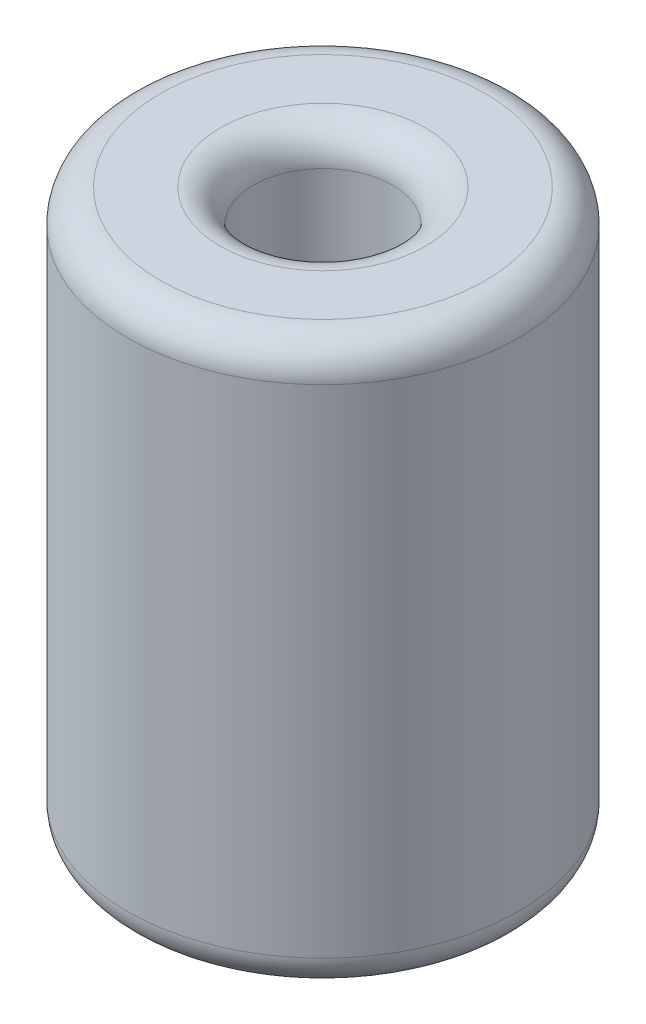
ISO-10303-21;
HEADER;
FILE_DESCRIPTION(('STEP AP214'),'2;1');
FILE_NAME('part.step','',(''),(''),'','','');
FILE_SCHEMA(('AUTOMOTIVE_DESIGN { 1 0 10303 214 1 1 1 1 }'));
ENDSEC;
DATA;
#1=APPLICATION_CONTEXT('core data for automotive mechanical design processes');
#2=APPLICATION_PROTOCOL_DEFINITION('international standard','automotive_design',2000,#1);
#3=PRODUCT_CONTEXT('',#1,'mechanical');
#4=PRODUCT('Part','Part','',(#3));
#5=PRODUCT_RELATED_PRODUCT_CATEGORY('part','',(#4));
#6=PRODUCT_DEFINITION_FORMATION('','',#4);
#7=PRODUCT_DEFINITION_CONTEXT('part definition',#1,'design');
#8=PRODUCT_DEFINITION('design','',#6,#7);
#9=PRODUCT_DEFINITION_SHAPE('','',#8);
#10=(LENGTH_UNIT() NAMED_UNIT(*) SI_UNIT(.MILLI.,.METRE.));
#11=(NAMED_UNIT(*) PLANE_ANGLE_UNIT() SI_UNIT($,.RADIAN.));
#12=(NAMED_UNIT(*) SI_UNIT($,.STERADIAN.) SOLID_ANGLE_UNIT());
#13=UNCERTAINTY_MEASURE_WITH_UNIT(LENGTH_MEASURE(1.E-05),#10,'distance_accuracy_value','');
#14=(GEOMETRIC_REPRESENTATION_CONTEXT(3) GLOBAL_UNCERTAINTY_ASSIGNED_CONTEXT((#13)) GLOBAL_UNIT_ASSIGNED_CONTEXT((#10,
#11,#12)) REPRESENTATION_CONTEXT('',''));
#15=CARTESIAN_POINT('',(0.,0.,0.));
#16=DIRECTION('',(0.,0.,1.));
#17=DIRECTION('',(1.,0.,0.));
#18=AXIS2_PLACEMENT_3D('',#15,#16,#17);
#19=CARTESIAN_POINT('',(0.,4.25,0.));
#20=DIRECTION('',(0.,-1.,0.));
#21=DIRECTION('',(0.,0.,-1.));
#22=AXIS2_PLACEMENT_3D('',#19,#20,#21);
#23=CYLINDRICAL_SURFACE('',#22,2.95);
#24=CARTESIAN_POINT('',(-2.95,-1.5,0.));
#25=CARTESIAN_POINT('',(-2.94999559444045,-1.49999496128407,-0.0786967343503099));
#26=CARTESIAN_POINT('',(-2.94681741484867,-1.49377050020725,-0.157482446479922));
#27=CARTESIAN_POINT('',(-2.93441666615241,-1.46915276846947,-0.312715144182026));
#28=CARTESIAN_POINT('',(-2.92518313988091,-1.45073743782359,-0.389157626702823));
#29=CARTESIAN_POINT('',(-2.90163573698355,-1.40264971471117,-0.537223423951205));
#30=CARTESIAN_POINT('',(-2.88734183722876,-1.37302155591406,-0.608864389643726));
#31=CARTESIAN_POINT('',(-2.85497614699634,-1.30358372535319,-0.746046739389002));
#32=CARTESIAN_POINT('',(-2.8369045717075,-1.26377463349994,-0.811588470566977));
#33=CARTESIAN_POINT('',(-2.79731963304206,-1.17230594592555,-0.939278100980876));
#34=CARTESIAN_POINT('',(-2.77566241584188,-1.12006504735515,-1.00096431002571));
#35=CARTESIAN_POINT('',(-2.73180123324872,-1.00647106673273,-1.11512740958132));
#36=CARTESIAN_POINT('',(-2.70959685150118,-0.945110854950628,-1.16759702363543));
#37=CARTESIAN_POINT('',(-2.66507891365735,-0.809073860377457,-1.26609937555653));
#38=CARTESIAN_POINT('',(-2.64290184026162,-0.733721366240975,-1.31126800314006));
#39=CARTESIAN_POINT('',(-2.6033735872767,-0.575249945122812,-1.38810120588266));
#40=CARTESIAN_POINT('',(-2.58601888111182,-0.492136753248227,-1.41977565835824));
#41=CARTESIAN_POINT('',(-2.5597281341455,-0.325629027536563,-1.46662160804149));
#42=CARTESIAN_POINT('',(-2.5503450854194,-0.242557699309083,-1.48267800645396));
#43=CARTESIAN_POINT('',(-2.53988787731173,-0.074414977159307,-1.50052972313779));
#44=CARTESIAN_POINT('',(-2.53880498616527,0.0106542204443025,-1.50234002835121));
#45=CARTESIAN_POINT('',(-2.54471334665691,0.168959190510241,-1.49229623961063));
#46=CARTESIAN_POINT('',(-2.55071438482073,0.242347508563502,-1.48211829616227));
#47=CARTESIAN_POINT('',(-2.56837257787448,0.386183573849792,-1.45130098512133));
#48=CARTESIAN_POINT('',(-2.5800316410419,0.456630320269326,-1.43065808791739));
#49=CARTESIAN_POINT('',(-2.60794245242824,0.594596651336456,-1.37913281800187));
#50=CARTESIAN_POINT('',(-2.62429445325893,0.662010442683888,-1.34802405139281));
#51=CARTESIAN_POINT('',(-2.65975794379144,0.790989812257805,-1.27662645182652));
#52=CARTESIAN_POINT('',(-2.67887067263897,0.852552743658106,-1.23633349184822));
#53=CARTESIAN_POINT('',(-2.720742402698,0.976620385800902,-1.1415265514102));
#54=CARTESIAN_POINT('',(-2.74365007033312,1.03818089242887,-1.08583843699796));
#55=CARTESIAN_POINT('',(-2.78849783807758,1.15149042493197,-0.964854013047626));
#56=CARTESIAN_POINT('',(-2.81043744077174,1.20323445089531,-0.899552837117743));
#57=CARTESIAN_POINT('',(-2.85220150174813,1.29786214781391,-0.757110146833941));
#58=CARTESIAN_POINT('',(-2.87186731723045,1.3401798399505,-0.679542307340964));
#59=CARTESIAN_POINT('',(-2.90549878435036,1.41081253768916,-0.517136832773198));
#60=CARTESIAN_POINT('',(-2.91946910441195,1.43913901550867,-0.43230522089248));
#61=CARTESIAN_POINT('',(-2.93912722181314,1.47859188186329,-0.265479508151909));
#62=CARTESIAN_POINT('',(-2.94541620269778,1.49097164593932,-0.183853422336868));
#63=CARTESIAN_POINT('',(-2.95107992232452,1.50213151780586,-0.019452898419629));
#64=CARTESIAN_POINT('',(-2.95045810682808,1.50091840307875,0.0633209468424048));
#65=CARTESIAN_POINT('',(-2.94271229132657,1.48562786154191,0.220552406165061));
#66=CARTESIAN_POINT('',(-2.93611742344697,1.47259718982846,0.29514180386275));
#67=CARTESIAN_POINT('',(-2.91778867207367,1.4357041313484,0.440917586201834));
#68=CARTESIAN_POINT('',(-2.90605423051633,1.41184056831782,0.512103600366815));
#69=CARTESIAN_POINT('',(-2.8780936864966,1.3533660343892,0.651355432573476));
#70=CARTESIAN_POINT('',(-2.8617517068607,1.31847453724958,0.719279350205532));
#71=CARTESIAN_POINT('',(-2.8261287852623,1.23925580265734,0.848526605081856));
#72=CARTESIAN_POINT('',(-2.8068466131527,1.19492461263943,0.909847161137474));
#73=CARTESIAN_POINT('',(-2.7648953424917,1.09294087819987,1.03070145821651));
#74=CARTESIAN_POINT('',(-2.74208071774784,1.03439635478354,1.08943325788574));
#75=CARTESIAN_POINT('',(-2.69703569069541,0.908278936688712,1.19661414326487));
#76=CARTESIAN_POINT('',(-2.67480573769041,0.84069932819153,1.2450555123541));
#77=CARTESIAN_POINT('',(-2.63227429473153,0.693937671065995,1.33271643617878));
#78=CARTESIAN_POINT('',(-2.61213733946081,0.6143306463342,1.3713115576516));
#79=CARTESIAN_POINT('',(-2.57818152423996,0.448406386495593,1.43414563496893));
#80=CARTESIAN_POINT('',(-2.56435427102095,0.36209824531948,1.4584036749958));
#81=CARTESIAN_POINT('',(-2.5463542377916,0.194152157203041,1.48958905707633));
#82=CARTESIAN_POINT('',(-2.54137562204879,0.112872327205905,1.49796824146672));
#83=CARTESIAN_POINT('',(-2.53936711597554,-0.0500488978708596,1.50137389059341));
#84=CARTESIAN_POINT('',(-2.54233336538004,-0.131690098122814,1.49640684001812));
#85=CARTESIAN_POINT('',(-2.55501383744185,-0.284252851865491,1.47462944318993));
#86=CARTESIAN_POINT('',(-2.56401198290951,-0.35542088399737,1.4590734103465));
#87=CARTESIAN_POINT('',(-2.58687087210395,-0.494046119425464,1.41814848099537));
#88=CARTESIAN_POINT('',(-2.60073322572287,-0.561502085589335,1.39277633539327));
#89=CARTESIAN_POINT('',(-2.6328863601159,-0.695793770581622,1.33105008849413));
#90=CARTESIAN_POINT('',(-2.6514113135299,-0.76228626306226,1.29407498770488));
#91=CARTESIAN_POINT('',(-2.69043287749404,-0.888561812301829,1.2108602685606));
#92=CARTESIAN_POINT('',(-2.71093052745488,-0.948341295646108,1.16461575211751));
#93=CARTESIAN_POINT('',(-2.75470812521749,-1.06740928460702,1.05728454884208));
#94=CARTESIAN_POINT('',(-2.77801029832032,-1.12566789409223,0.995058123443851));
#95=CARTESIAN_POINT('',(-2.8224073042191,-1.23116839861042,0.861099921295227));
#96=CARTESIAN_POINT('',(-2.84350089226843,-1.27840409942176,0.789362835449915));
#97=CARTESIAN_POINT('',(-2.88146124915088,-1.36076086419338,0.637104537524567));
#98=CARTESIAN_POINT('',(-2.8982791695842,-1.39574350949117,0.556495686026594));
#99=CARTESIAN_POINT('',(-2.92538376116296,-1.45119342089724,0.389522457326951));
#100=CARTESIAN_POINT('',(-2.93568872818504,-1.47170136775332,0.303174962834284));
#101=CARTESIAN_POINT('',(-2.94472774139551,-1.48960901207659,0.179916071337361));
#102=CARTESIAN_POINT('',(-2.94669929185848,-1.4934997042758,0.14407898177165));
#103=CARTESIAN_POINT('',(-2.94933644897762,-1.49869638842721,0.0721675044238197));
#104=CARTESIAN_POINT('',(-2.95000202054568,-1.50000231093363,0.036093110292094));
#105=CARTESIAN_POINT('',(-2.95,-1.5,0.));
#106=B_SPLINE_CURVE_WITH_KNOTS('',3,(#24,#25,#26,#27,#28,#29,#30,#31,#32,#33,#34,#35,#36,#37,
#38,#39,#40,#41,#42,#43,#44,#45,#46,#47,#48,#49,#50,#51,#52,#53,#54,#55,#56,#57,#58,#59,#60,#61,
#62,#63,#64,#65,#66,#67,#68,#69,#70,#71,#72,#73,#74,#75,#76,#77,#78,#79,#80,#81,#82,#83,#84,#85,
#86,#87,#88,#89,#90,#91,#92,#93,#94,#95,#96,#97,#98,#99,#100,#101,#102,#103,#104,#105),
.UNSPECIFIED.,.T.,.F.,(4,2,2,2,2,2,2,2,2,2,2,2,2,2,2,2,2,2,2,2,2,2,2,2,2,2,2,2,2,2,2,2,2,2,2,2,
2,2,2,2,4),(0.,0.235943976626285,0.472316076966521,0.707765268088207,0.943201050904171,
1.19322016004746,1.44343577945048,1.7138932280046,1.98415236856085,2.23800942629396,
2.49159938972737,2.71355996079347,2.9355954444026,3.16278092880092,3.39006870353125,
3.64729673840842,3.90465543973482,4.1747645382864,4.44465178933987,4.69168514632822,
4.9385953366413,5.16556655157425,5.39256241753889,5.6258733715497,5.85928220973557,
6.1161984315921,6.37330663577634,6.64403450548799,6.91440119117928,7.15856353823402,
7.40260727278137,7.62186068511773,7.84118673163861,8.07518171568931,8.30930067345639,
8.57320286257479,8.8372529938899,9.10419647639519,9.37038670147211,9.47859606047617,
9.58680832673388),.UNSPECIFIED.);
#107=CARTESIAN_POINT('',(-2.95,-1.5,0.));
#108=VERTEX_POINT('',#107);
#109=EDGE_CURVE('E59',#108,#108,#106,.T.);
#110=ORIENTED_EDGE('',*,*,#109,.T.);
#111=EDGE_LOOP('',(#110));
#112=FACE_BOUND('',#111,.T.);
#113=CARTESIAN_POINT('',(0.,-3.75,0.));
#114=DIRECTION('',(0.,1.,0.));
#115=DIRECTION('',(0.,0.,1.));
#116=AXIS2_PLACEMENT_3D('',#113,#114,#115);
#117=CIRCLE('',#116,2.95);
#118=CARTESIAN_POINT('',(0.,-3.75,2.95));
#119=VERTEX_POINT('',#118);
#120=EDGE_CURVE('E101',#119,#119,#117,.T.);
#121=ORIENTED_EDGE('',*,*,#120,.T.);
#122=EDGE_LOOP('',(#121));
#123=FACE_BOUND('',#122,.T.);
#124=CARTESIAN_POINT('',(0.,3.75,0.));
#125=DIRECTION('',(0.,1.,0.));
#126=DIRECTION('',(0.,0.,1.));
#127=AXIS2_PLACEMENT_3D('',#124,#125,#126);
#128=CIRCLE('',#127,2.95);
#129=CARTESIAN_POINT('',(0.,3.75,2.95));
#130=VERTEX_POINT('',#129);
#131=EDGE_CURVE('E104',#130,#130,#128,.F.);
#132=ORIENTED_EDGE('',*,*,#131,.T.);
#133=EDGE_LOOP('',(#132));
#134=FACE_BOUND('',#133,.T.);
#135=ADVANCED_FACE('F39',(#112,#123,#134),#23,.T.);
#136=CARTESIAN_POINT('',(0.,4.25,0.));
#137=DIRECTION('',(0.,1.,0.));
#138=DIRECTION('',(0.,0.,1.));
#139=AXIS2_PLACEMENT_3D('',#136,#137,#138);
#140=PLANE('',#139);
#141=CARTESIAN_POINT('',(0.,4.25,0.));
#142=DIRECTION('',(0.,1.,0.));
#143=DIRECTION('',(0.,0.,1.));
#144=AXIS2_PLACEMENT_3D('',#141,#142,#143);
#145=CIRCLE('',#144,1.55);
#146=CARTESIAN_POINT('',(0.,4.25,1.55));
#147=VERTEX_POINT('',#146);
#148=EDGE_CURVE('E10',#147,#147,#145,.F.);
#149=ORIENTED_EDGE('',*,*,#148,.T.);
#150=EDGE_LOOP('',(#149));
#151=FACE_BOUND('',#150,.T.);
#152=CARTESIAN_POINT('',(0.,4.25,0.));
#153=DIRECTION('',(0.,1.,0.));
#154=DIRECTION('',(0.,0.,1.));
#155=AXIS2_PLACEMENT_3D('',#152,#153,#154);
#156=CIRCLE('',#155,2.45);
#157=CARTESIAN_POINT('',(0.,4.25,2.45));
#158=VERTEX_POINT('',#157);
#159=EDGE_CURVE('E67',#158,#158,#156,.T.);
#160=ORIENTED_EDGE('',*,*,#159,.T.);
#161=EDGE_LOOP('',(#160));
#162=FACE_BOUND('',#161,.T.);
#163=ADVANCED_FACE('F81',(#151,#162),#140,.T.);
#164=CARTESIAN_POINT('',(0.,-4.25,0.));
#165=DIRECTION('',(0.,1.,0.));
#166=DIRECTION('',(0.,0.,1.));
#167=AXIS2_PLACEMENT_3D('',#164,#165,#166);
#168=PLANE('',#167);
#169=CARTESIAN_POINT('',(0.,-4.25,0.));
#170=DIRECTION('',(0.,1.,0.));
#171=DIRECTION('',(0.,0.,1.));
#172=AXIS2_PLACEMENT_3D('',#169,#170,#171);
#173=CIRCLE('',#172,1.55);
#174=CARTESIAN_POINT('',(0.,-4.25,1.55));
#175=VERTEX_POINT('',#174);
#176=EDGE_CURVE('E54',#175,#175,#173,.T.);
#177=ORIENTED_EDGE('',*,*,#176,.T.);
#178=EDGE_LOOP('',(#177));
#179=FACE_BOUND('',#178,.T.);
#180=CARTESIAN_POINT('',(0.,-4.25,0.));
#181=DIRECTION('',(0.,1.,0.));
#182=DIRECTION('',(0.,0.,1.));
#183=AXIS2_PLACEMENT_3D('',#180,#181,#182);
#184=CIRCLE('',#183,2.45);
#185=CARTESIAN_POINT('',(0.,-4.25,2.45));
#186=VERTEX_POINT('',#185);
#187=EDGE_CURVE('E108',#186,#186,#184,.F.);
#188=ORIENTED_EDGE('',*,*,#187,.T.);
#189=EDGE_LOOP('',(#188));
#190=FACE_BOUND('',#189,.T.);
#191=ADVANCED_FACE('F83',(#179,#190),#168,.F.);
#192=CARTESIAN_POINT('',(0.,-3.75,0.));
#193=DIRECTION('',(0.,1.,0.));
#194=DIRECTION('',(0.,0.,1.));
#195=AXIS2_PLACEMENT_3D('',#192,#193,#194);
#196=TOROIDAL_SURFACE('',#195,2.45,0.5);
#197=ORIENTED_EDGE('',*,*,#187,.F.);
#198=EDGE_LOOP('',(#197));
#199=FACE_BOUND('',#198,.T.);
#200=ORIENTED_EDGE('',*,*,#120,.F.);
#201=EDGE_LOOP('',(#200));
#202=FACE_BOUND('',#201,.T.);
#203=ADVANCED_FACE('F85',(#199,#202),#196,.T.);
#204=CARTESIAN_POINT('',(0.,3.75,0.));
#205=DIRECTION('',(0.,1.,0.));
#206=DIRECTION('',(0.,0.,1.));
#207=AXIS2_PLACEMENT_3D('',#204,#205,#206);
#208=TOROIDAL_SURFACE('',#207,2.45,0.5);
#209=ORIENTED_EDGE('',*,*,#131,.F.);
#210=EDGE_LOOP('',(#209));
#211=FACE_BOUND('',#210,.T.);
#212=ORIENTED_EDGE('',*,*,#159,.F.);
#213=EDGE_LOOP('',(#212));
#214=FACE_BOUND('',#213,.T.);
#215=ADVANCED_FACE('F78',(#211,#214),#208,.T.);
#216=CARTESIAN_POINT('',(-2.95,0.,0.));
#217=DIRECTION('',(1.,0.,0.));
#218=DIRECTION('',(0.,0.,-1.));
#219=AXIS2_PLACEMENT_3D('',#216,#217,#218);
#220=CYLINDRICAL_SURFACE('',#219,1.5);
#221=CARTESIAN_POINT('',(-1.5,0.,0.));
#222=DIRECTION('',(1.,0.,0.));
#223=DIRECTION('',(0.,0.,-1.));
#224=AXIS2_PLACEMENT_3D('',#221,#222,#223);
#225=CIRCLE('',#224,1.5);
#226=CARTESIAN_POINT('',(-1.5,0.,-1.5));
#227=VERTEX_POINT('',#226);
#228=EDGE_CURVE('E106',#227,#227,#225,.T.);
#229=ORIENTED_EDGE('',*,*,#228,.T.);
#230=EDGE_LOOP('',(#229));
#231=FACE_BOUND('',#230,.T.);
#232=ORIENTED_EDGE('',*,*,#109,.F.);
#233=EDGE_LOOP('',(#232));
#234=FACE_BOUND('',#233,.T.);
#235=ADVANCED_FACE('F72',(#231,#234),#220,.F.);
#236=CARTESIAN_POINT('',(-1.5,0.,0.));
#237=DIRECTION('',(1.,0.,0.));
#238=DIRECTION('',(0.,0.,-1.));
#239=AXIS2_PLACEMENT_3D('',#236,#237,#238);
#240=PLANE('',#239);
#241=ORIENTED_EDGE('',*,*,#228,.F.);
#242=EDGE_LOOP('',(#241));
#243=FACE_BOUND('',#242,.T.);
#244=ADVANCED_FACE('F77',(#243),#240,.F.);
#245=CARTESIAN_POINT('',(0.,-4.25,0.));
#246=DIRECTION('',(0.,1.,0.));
#247=DIRECTION('',(0.,0.,1.));
#248=AXIS2_PLACEMENT_3D('',#245,#246,#247);
#249=CYLINDRICAL_SURFACE('',#248,1.05);
#250=CARTESIAN_POINT('',(0.,-3.75,0.));
#251=DIRECTION('',(0.,1.,0.));
#252=DIRECTION('',(0.,0.,1.));
#253=AXIS2_PLACEMENT_3D('',#250,#251,#252);
#254=CIRCLE('',#253,1.05);
#255=CARTESIAN_POINT('',(0.,-3.75,1.05));
#256=VERTEX_POINT('',#255);
#257=EDGE_CURVE('E46',#256,#256,#254,.F.);
#258=ORIENTED_EDGE('',*,*,#257,.T.);
#259=EDGE_LOOP('',(#258));
#260=FACE_BOUND('',#259,.T.);
#261=CARTESIAN_POINT('',(0.,3.75,0.));
#262=DIRECTION('',(0.,1.,0.));
#263=DIRECTION('',(0.,0.,1.));
#264=AXIS2_PLACEMENT_3D('',#261,#262,#263);
#265=CIRCLE('',#264,1.05);
#266=CARTESIAN_POINT('',(0.,3.75,1.05));
#267=VERTEX_POINT('',#266);
#268=EDGE_CURVE('E50',#267,#267,#265,.T.);
#269=ORIENTED_EDGE('',*,*,#268,.T.);
#270=EDGE_LOOP('',(#269));
#271=FACE_BOUND('',#270,.T.);
#272=ADVANCED_FACE('F124',(#260,#271),#249,.F.);
#273=CARTESIAN_POINT('',(0.,-3.75,0.));
#274=DIRECTION('',(0.,1.,0.));
#275=DIRECTION('',(0.,0.,1.));
#276=AXIS2_PLACEMENT_3D('',#273,#274,#275);
#277=TOROIDAL_SURFACE('',#276,1.55,0.5);
#278=ORIENTED_EDGE('',*,*,#257,.F.);
#279=EDGE_LOOP('',(#278));
#280=FACE_BOUND('',#279,.T.);
#281=ORIENTED_EDGE('',*,*,#176,.F.);
#282=EDGE_LOOP('',(#281));
#283=FACE_BOUND('',#282,.T.);
#284=ADVANCED_FACE('F122',(#280,#283),#277,.T.);
#285=CARTESIAN_POINT('',(0.,3.75,0.));
#286=DIRECTION('',(0.,1.,0.));
#287=DIRECTION('',(0.,0.,1.));
#288=AXIS2_PLACEMENT_3D('',#285,#286,#287);
#289=TOROIDAL_SURFACE('',#288,1.55,0.5);
#290=ORIENTED_EDGE('',*,*,#148,.F.);
#291=EDGE_LOOP('',(#290));
#292=FACE_BOUND('',#291,.T.);
#293=ORIENTED_EDGE('',*,*,#268,.F.);
#294=EDGE_LOOP('',(#293));
#295=FACE_BOUND('',#294,.T.);
#296=ADVANCED_FACE('F41',(#292,#295),#289,.T.);
#297=CLOSED_SHELL('',(#135,#163,#191,#203,#215,#235,#244,#272,#284,#296));
#298=MANIFOLD_SOLID_BREP('B2',#297);
#299=ADVANCED_BREP_SHAPE_REPRESENTATION('',(#18,#298),#14);
#300=SHAPE_DEFINITION_REPRESENTATION(#9,#299);
ENDSEC;
END-ISO-10303-21;
